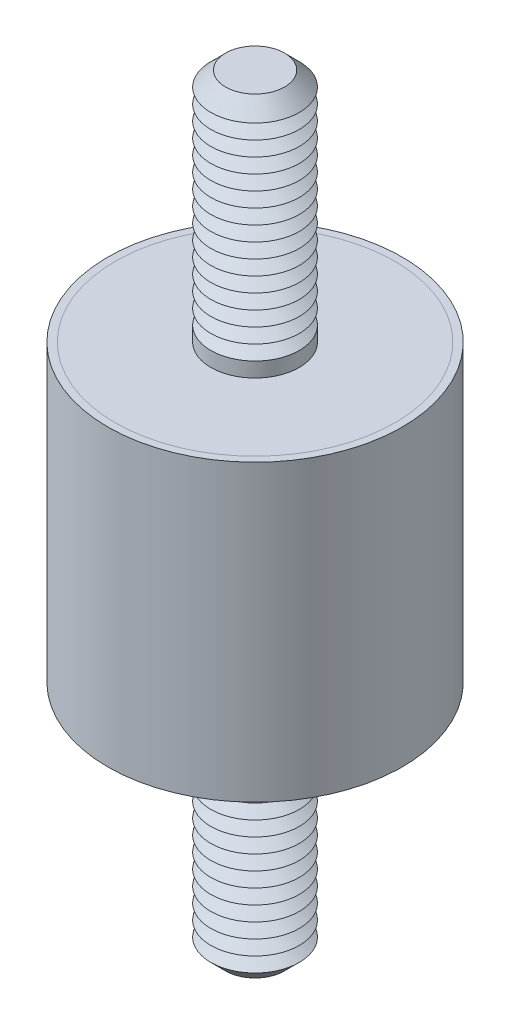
ISO-10303-21;
HEADER;
FILE_DESCRIPTION(('STEP AP214'),'2;1');
FILE_NAME('part.step','',(''),(''),'','','');
FILE_SCHEMA(('AUTOMOTIVE_DESIGN { 1 0 10303 214 1 1 1 1 }'));
ENDSEC;
DATA;
#1=APPLICATION_CONTEXT('core data for automotive mechanical design processes');
#2=APPLICATION_PROTOCOL_DEFINITION('international standard','automotive_design',2000,#1);
#3=PRODUCT_CONTEXT('',#1,'mechanical');
#4=PRODUCT('Part','Part','',(#3));
#5=PRODUCT_RELATED_PRODUCT_CATEGORY('part','',(#4));
#6=PRODUCT_DEFINITION_FORMATION('','',#4);
#7=PRODUCT_DEFINITION_CONTEXT('part definition',#1,'design');
#8=PRODUCT_DEFINITION('design','',#6,#7);
#9=PRODUCT_DEFINITION_SHAPE('','',#8);
#10=(LENGTH_UNIT() NAMED_UNIT(*) SI_UNIT(.MILLI.,.METRE.));
#11=(NAMED_UNIT(*) PLANE_ANGLE_UNIT() SI_UNIT($,.RADIAN.));
#12=(NAMED_UNIT(*) SI_UNIT($,.STERADIAN.) SOLID_ANGLE_UNIT());
#13=UNCERTAINTY_MEASURE_WITH_UNIT(LENGTH_MEASURE(1.E-05),#10,'distance_accuracy_value','');
#14=(GEOMETRIC_REPRESENTATION_CONTEXT(3) GLOBAL_UNCERTAINTY_ASSIGNED_CONTEXT((#13)) GLOBAL_UNIT_ASSIGNED_CONTEXT((#10,
#11,#12)) REPRESENTATION_CONTEXT('',''));
#15=CARTESIAN_POINT('',(0.,0.,0.));
#16=DIRECTION('',(0.,0.,1.));
#17=DIRECTION('',(1.,0.,0.));
#18=AXIS2_PLACEMENT_3D('',#15,#16,#17);
#19=CARTESIAN_POINT('',(0.,-26.,0.));
#20=DIRECTION('',(0.,1.,0.));
#21=DIRECTION('',(0.,0.,1.));
#22=AXIS2_PLACEMENT_3D('',#19,#20,#21);
#23=CYLINDRICAL_SURFACE('',#22,3.);
#24=CARTESIAN_POINT('',(0.,-10.,0.));
#25=DIRECTION('',(0.,-1.,0.));
#26=DIRECTION('',(0.,0.,-1.));
#27=AXIS2_PLACEMENT_3D('',#24,#25,#26);
#28=CIRCLE('',#27,3.);
#29=CARTESIAN_POINT('',(0.,-10.,-3.));
#30=VERTEX_POINT('',#29);
#31=EDGE_CURVE('P0_E21',#30,#30,#28,.T.);
#32=ORIENTED_EDGE('',*,*,#31,.T.);
#33=EDGE_LOOP('',(#32));
#34=FACE_BOUND('',#33,.T.);
#35=CARTESIAN_POINT('',(0.,-11.,0.));
#36=DIRECTION('',(0.,1.,0.));
#37=DIRECTION('',(0.,0.,1.));
#38=AXIS2_PLACEMENT_3D('',#35,#36,#37);
#39=CIRCLE('',#38,3.);
#40=CARTESIAN_POINT('',(0.,-11.,3.));
#41=VERTEX_POINT('',#40);
#42=EDGE_CURVE('P0_E33',#41,#41,#39,.T.);
#43=ORIENTED_EDGE('',*,*,#42,.T.);
#44=EDGE_LOOP('',(#43));
#45=FACE_BOUND('',#44,.T.);
#46=ADVANCED_FACE('P0_F14',(#34,#45),#23,.T.);
#47=CARTESIAN_POINT('',(0.,-10.,0.));
#48=DIRECTION('',(0.,1.,0.));
#49=DIRECTION('',(0.,0.,1.));
#50=AXIS2_PLACEMENT_3D('',#47,#48,#49);
#51=CYLINDRICAL_SURFACE('',#50,9.5);
#52=CARTESIAN_POINT('',(0.,-10.,0.));
#53=DIRECTION('',(0.,1.,0.));
#54=DIRECTION('',(0.,0.,1.));
#55=AXIS2_PLACEMENT_3D('',#52,#53,#54);
#56=CIRCLE('',#55,9.5);
#57=CARTESIAN_POINT('',(0.,-10.,9.5));
#58=VERTEX_POINT('',#57);
#59=EDGE_CURVE('P0_E25',#58,#58,#56,.T.);
#60=ORIENTED_EDGE('',*,*,#59,.T.);
#61=EDGE_LOOP('',(#60));
#62=FACE_BOUND('',#61,.T.);
#63=CARTESIAN_POINT('',(0.,-9.,0.));
#64=DIRECTION('',(0.,1.,0.));
#65=DIRECTION('',(0.,0.,1.));
#66=AXIS2_PLACEMENT_3D('',#63,#64,#65);
#67=CIRCLE('',#66,9.5);
#68=CARTESIAN_POINT('',(0.,-9.,9.5));
#69=VERTEX_POINT('',#68);
#70=EDGE_CURVE('P0_E30',#69,#69,#67,.T.);
#71=ORIENTED_EDGE('',*,*,#70,.F.);
#72=EDGE_LOOP('',(#71));
#73=FACE_BOUND('',#72,.T.);
#74=ADVANCED_FACE('P0_F145',(#62,#73),#51,.T.);
#75=CARTESIAN_POINT('',(0.,-10.,0.));
#76=DIRECTION('',(0.,1.,0.));
#77=DIRECTION('',(0.,0.,1.));
#78=AXIS2_PLACEMENT_3D('',#75,#76,#77);
#79=PLANE('',#78);
#80=ORIENTED_EDGE('',*,*,#31,.F.);
#81=EDGE_LOOP('',(#80));
#82=FACE_BOUND('',#81,.T.);
#83=ORIENTED_EDGE('',*,*,#59,.F.);
#84=EDGE_LOOP('',(#83));
#85=FACE_BOUND('',#84,.T.);
#86=ADVANCED_FACE('P0_F150',(#82,#85),#79,.F.);
#87=CARTESIAN_POINT('',(0.,-9.,0.));
#88=DIRECTION('',(0.,1.,0.));
#89=DIRECTION('',(0.,0.,1.));
#90=AXIS2_PLACEMENT_3D('',#87,#88,#89);
#91=PLANE('',#90);
#92=ORIENTED_EDGE('',*,*,#70,.T.);
#93=EDGE_LOOP('',(#92));
#94=FACE_BOUND('',#93,.T.);
#95=ADVANCED_FACE('P0_F156',(#94),#91,.T.);
#96=CARTESIAN_POINT('',(0.,-11.,0.));
#97=DIRECTION('',(0.,1.,0.));
#98=DIRECTION('',(0.,0.,1.));
#99=AXIS2_PLACEMENT_3D('',#96,#97,#98);
#100=CONICAL_SURFACE('',#99,3.,1.0471975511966);
#101=CARTESIAN_POINT('',(0.,-11.5,0.));
#102=DIRECTION('',(0.,1.,0.));
#103=DIRECTION('',(0.,0.,1.));
#104=AXIS2_PLACEMENT_3D('',#101,#102,#103);
#105=CIRCLE('',#104,2.13397459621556);
#106=CARTESIAN_POINT('',(0.,-11.5,2.13397459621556));
#107=VERTEX_POINT('',#106);
#108=EDGE_CURVE('P0_E39',#107,#107,#105,.T.);
#109=ORIENTED_EDGE('',*,*,#108,.T.);
#110=EDGE_LOOP('',(#109));
#111=FACE_BOUND('',#110,.T.);
#112=ORIENTED_EDGE('',*,*,#42,.F.);
#113=EDGE_LOOP('',(#112));
#114=FACE_BOUND('',#113,.T.);
#115=ADVANCED_FACE('P0_F159',(#111,#114),#100,.T.);
#116=CARTESIAN_POINT('',(0.,-11.5,0.));
#117=DIRECTION('',(0.,-1.,0.));
#118=DIRECTION('',(0.,0.,-1.));
#119=AXIS2_PLACEMENT_3D('',#116,#117,#118);
#120=CONICAL_SURFACE('',#119,2.13397459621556,1.0471975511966);
#121=CARTESIAN_POINT('',(0.,-12.,0.));
#122=DIRECTION('',(0.,1.,0.));
#123=DIRECTION('',(0.,0.,1.));
#124=AXIS2_PLACEMENT_3D('',#121,#122,#123);
#125=CIRCLE('',#124,3.);
#126=CARTESIAN_POINT('',(0.,-12.,3.));
#127=VERTEX_POINT('',#126);
#128=EDGE_CURVE('P0_E43',#127,#127,#125,.T.);
#129=ORIENTED_EDGE('',*,*,#128,.T.);
#130=EDGE_LOOP('',(#129));
#131=FACE_BOUND('',#130,.T.);
#132=ORIENTED_EDGE('',*,*,#108,.F.);
#133=EDGE_LOOP('',(#132));
#134=FACE_BOUND('',#133,.T.);
#135=ADVANCED_FACE('P0_F163',(#131,#134),#120,.T.);
#136=CARTESIAN_POINT('',(0.,-12.,0.));
#137=DIRECTION('',(0.,1.,0.));
#138=DIRECTION('',(0.,0.,1.));
#139=AXIS2_PLACEMENT_3D('',#136,#137,#138);
#140=CONICAL_SURFACE('',#139,3.,1.0471975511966);
#141=CARTESIAN_POINT('',(0.,-12.5,0.));
#142=DIRECTION('',(0.,1.,0.));
#143=DIRECTION('',(0.,0.,1.));
#144=AXIS2_PLACEMENT_3D('',#141,#142,#143);
#145=CIRCLE('',#144,2.13397459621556);
#146=CARTESIAN_POINT('',(0.,-12.5,2.13397459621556));
#147=VERTEX_POINT('',#146);
#148=EDGE_CURVE('P0_E47',#147,#147,#145,.T.);
#149=ORIENTED_EDGE('',*,*,#148,.T.);
#150=EDGE_LOOP('',(#149));
#151=FACE_BOUND('',#150,.T.);
#152=ORIENTED_EDGE('',*,*,#128,.F.);
#153=EDGE_LOOP('',(#152));
#154=FACE_BOUND('',#153,.T.);
#155=ADVANCED_FACE('P0_F167',(#151,#154),#140,.T.);
#156=CARTESIAN_POINT('',(0.,-12.5,0.));
#157=DIRECTION('',(0.,-1.,0.));
#158=DIRECTION('',(0.,0.,-1.));
#159=AXIS2_PLACEMENT_3D('',#156,#157,#158);
#160=CONICAL_SURFACE('',#159,2.13397459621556,1.0471975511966);
#161=CARTESIAN_POINT('',(0.,-13.,0.));
#162=DIRECTION('',(0.,1.,0.));
#163=DIRECTION('',(0.,0.,1.));
#164=AXIS2_PLACEMENT_3D('',#161,#162,#163);
#165=CIRCLE('',#164,3.);
#166=CARTESIAN_POINT('',(0.,-13.,3.));
#167=VERTEX_POINT('',#166);
#168=EDGE_CURVE('P0_E52',#167,#167,#165,.T.);
#169=ORIENTED_EDGE('',*,*,#168,.T.);
#170=EDGE_LOOP('',(#169));
#171=FACE_BOUND('',#170,.T.);
#172=ORIENTED_EDGE('',*,*,#148,.F.);
#173=EDGE_LOOP('',(#172));
#174=FACE_BOUND('',#173,.T.);
#175=ADVANCED_FACE('P0_F174',(#171,#174),#160,.T.);
#176=CARTESIAN_POINT('',(0.,-13.,0.));
#177=DIRECTION('',(0.,1.,0.));
#178=DIRECTION('',(0.,0.,1.));
#179=AXIS2_PLACEMENT_3D('',#176,#177,#178);
#180=CONICAL_SURFACE('',#179,3.,1.0471975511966);
#181=CARTESIAN_POINT('',(0.,-13.5,0.));
#182=DIRECTION('',(0.,1.,0.));
#183=DIRECTION('',(0.,0.,1.));
#184=AXIS2_PLACEMENT_3D('',#181,#182,#183);
#185=CIRCLE('',#184,2.13397459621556);
#186=CARTESIAN_POINT('',(0.,-13.5,2.13397459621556));
#187=VERTEX_POINT('',#186);
#188=EDGE_CURVE('P0_E55',#187,#187,#185,.T.);
#189=ORIENTED_EDGE('',*,*,#188,.T.);
#190=EDGE_LOOP('',(#189));
#191=FACE_BOUND('',#190,.T.);
#192=ORIENTED_EDGE('',*,*,#168,.F.);
#193=EDGE_LOOP('',(#192));
#194=FACE_BOUND('',#193,.T.);
#195=ADVANCED_FACE('P0_F178',(#191,#194),#180,.T.);
#196=CARTESIAN_POINT('',(0.,-13.5,0.));
#197=DIRECTION('',(0.,-1.,0.));
#198=DIRECTION('',(0.,0.,-1.));
#199=AXIS2_PLACEMENT_3D('',#196,#197,#198);
#200=CONICAL_SURFACE('',#199,2.13397459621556,1.0471975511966);
#201=CARTESIAN_POINT('',(0.,-14.,0.));
#202=DIRECTION('',(0.,1.,0.));
#203=DIRECTION('',(0.,0.,1.));
#204=AXIS2_PLACEMENT_3D('',#201,#202,#203);
#205=CIRCLE('',#204,3.);
#206=CARTESIAN_POINT('',(0.,-14.,3.));
#207=VERTEX_POINT('',#206);
#208=EDGE_CURVE('P0_E58',#207,#207,#205,.T.);
#209=ORIENTED_EDGE('',*,*,#208,.T.);
#210=EDGE_LOOP('',(#209));
#211=FACE_BOUND('',#210,.T.);
#212=ORIENTED_EDGE('',*,*,#188,.F.);
#213=EDGE_LOOP('',(#212));
#214=FACE_BOUND('',#213,.T.);
#215=ADVANCED_FACE('P0_F182',(#211,#214),#200,.T.);
#216=CARTESIAN_POINT('',(0.,-14.,0.));
#217=DIRECTION('',(0.,1.,0.));
#218=DIRECTION('',(0.,0.,1.));
#219=AXIS2_PLACEMENT_3D('',#216,#217,#218);
#220=CONICAL_SURFACE('',#219,3.,1.0471975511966);
#221=CARTESIAN_POINT('',(0.,-14.5,0.));
#222=DIRECTION('',(0.,1.,0.));
#223=DIRECTION('',(0.,0.,1.));
#224=AXIS2_PLACEMENT_3D('',#221,#222,#223);
#225=CIRCLE('',#224,2.13397459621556);
#226=CARTESIAN_POINT('',(0.,-14.5,2.13397459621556));
#227=VERTEX_POINT('',#226);
#228=EDGE_CURVE('P0_E61',#227,#227,#225,.T.);
#229=ORIENTED_EDGE('',*,*,#228,.T.);
#230=EDGE_LOOP('',(#229));
#231=FACE_BOUND('',#230,.T.);
#232=ORIENTED_EDGE('',*,*,#208,.F.);
#233=EDGE_LOOP('',(#232));
#234=FACE_BOUND('',#233,.T.);
#235=ADVANCED_FACE('P0_F186',(#231,#234),#220,.T.);
#236=CARTESIAN_POINT('',(0.,-14.5,0.));
#237=DIRECTION('',(0.,-1.,0.));
#238=DIRECTION('',(0.,0.,-1.));
#239=AXIS2_PLACEMENT_3D('',#236,#237,#238);
#240=CONICAL_SURFACE('',#239,2.13397459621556,1.0471975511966);
#241=CARTESIAN_POINT('',(0.,-15.,0.));
#242=DIRECTION('',(0.,1.,0.));
#243=DIRECTION('',(0.,0.,1.));
#244=AXIS2_PLACEMENT_3D('',#241,#242,#243);
#245=CIRCLE('',#244,3.);
#246=CARTESIAN_POINT('',(0.,-15.,3.));
#247=VERTEX_POINT('',#246);
#248=EDGE_CURVE('P0_E64',#247,#247,#245,.T.);
#249=ORIENTED_EDGE('',*,*,#248,.T.);
#250=EDGE_LOOP('',(#249));
#251=FACE_BOUND('',#250,.T.);
#252=ORIENTED_EDGE('',*,*,#228,.F.);
#253=EDGE_LOOP('',(#252));
#254=FACE_BOUND('',#253,.T.);
#255=ADVANCED_FACE('P0_F190',(#251,#254),#240,.T.);
#256=CARTESIAN_POINT('',(0.,-15.,0.));
#257=DIRECTION('',(0.,1.,0.));
#258=DIRECTION('',(0.,0.,1.));
#259=AXIS2_PLACEMENT_3D('',#256,#257,#258);
#260=CONICAL_SURFACE('',#259,3.,1.0471975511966);
#261=CARTESIAN_POINT('',(0.,-15.5,0.));
#262=DIRECTION('',(0.,1.,0.));
#263=DIRECTION('',(0.,0.,1.));
#264=AXIS2_PLACEMENT_3D('',#261,#262,#263);
#265=CIRCLE('',#264,2.13397459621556);
#266=CARTESIAN_POINT('',(0.,-15.5,2.13397459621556));
#267=VERTEX_POINT('',#266);
#268=EDGE_CURVE('P0_E67',#267,#267,#265,.T.);
#269=ORIENTED_EDGE('',*,*,#268,.T.);
#270=EDGE_LOOP('',(#269));
#271=FACE_BOUND('',#270,.T.);
#272=ORIENTED_EDGE('',*,*,#248,.F.);
#273=EDGE_LOOP('',(#272));
#274=FACE_BOUND('',#273,.T.);
#275=ADVANCED_FACE('P0_F194',(#271,#274),#260,.T.);
#276=CARTESIAN_POINT('',(0.,-15.5,0.));
#277=DIRECTION('',(0.,-1.,0.));
#278=DIRECTION('',(0.,0.,-1.));
#279=AXIS2_PLACEMENT_3D('',#276,#277,#278);
#280=CONICAL_SURFACE('',#279,2.13397459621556,1.0471975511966);
#281=CARTESIAN_POINT('',(0.,-16.,0.));
#282=DIRECTION('',(0.,1.,0.));
#283=DIRECTION('',(0.,0.,1.));
#284=AXIS2_PLACEMENT_3D('',#281,#282,#283);
#285=CIRCLE('',#284,3.);
#286=CARTESIAN_POINT('',(0.,-16.,3.));
#287=VERTEX_POINT('',#286);
#288=EDGE_CURVE('P0_E70',#287,#287,#285,.T.);
#289=ORIENTED_EDGE('',*,*,#288,.T.);
#290=EDGE_LOOP('',(#289));
#291=FACE_BOUND('',#290,.T.);
#292=ORIENTED_EDGE('',*,*,#268,.F.);
#293=EDGE_LOOP('',(#292));
#294=FACE_BOUND('',#293,.T.);
#295=ADVANCED_FACE('P0_F198',(#291,#294),#280,.T.);
#296=CARTESIAN_POINT('',(0.,-16.,0.));
#297=DIRECTION('',(0.,1.,0.));
#298=DIRECTION('',(0.,0.,1.));
#299=AXIS2_PLACEMENT_3D('',#296,#297,#298);
#300=CONICAL_SURFACE('',#299,3.,1.0471975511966);
#301=CARTESIAN_POINT('',(0.,-16.5,0.));
#302=DIRECTION('',(0.,1.,0.));
#303=DIRECTION('',(0.,0.,1.));
#304=AXIS2_PLACEMENT_3D('',#301,#302,#303);
#305=CIRCLE('',#304,2.13397459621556);
#306=CARTESIAN_POINT('',(0.,-16.5,2.13397459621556));
#307=VERTEX_POINT('',#306);
#308=EDGE_CURVE('P0_E73',#307,#307,#305,.T.);
#309=ORIENTED_EDGE('',*,*,#308,.T.);
#310=EDGE_LOOP('',(#309));
#311=FACE_BOUND('',#310,.T.);
#312=ORIENTED_EDGE('',*,*,#288,.F.);
#313=EDGE_LOOP('',(#312));
#314=FACE_BOUND('',#313,.T.);
#315=ADVANCED_FACE('P0_F202',(#311,#314),#300,.T.);
#316=CARTESIAN_POINT('',(0.,-16.5,0.));
#317=DIRECTION('',(0.,-1.,0.));
#318=DIRECTION('',(0.,0.,-1.));
#319=AXIS2_PLACEMENT_3D('',#316,#317,#318);
#320=CONICAL_SURFACE('',#319,2.13397459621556,1.0471975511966);
#321=CARTESIAN_POINT('',(0.,-17.,0.));
#322=DIRECTION('',(0.,1.,0.));
#323=DIRECTION('',(0.,0.,1.));
#324=AXIS2_PLACEMENT_3D('',#321,#322,#323);
#325=CIRCLE('',#324,3.);
#326=CARTESIAN_POINT('',(0.,-17.,3.));
#327=VERTEX_POINT('',#326);
#328=EDGE_CURVE('P0_E76',#327,#327,#325,.T.);
#329=ORIENTED_EDGE('',*,*,#328,.T.);
#330=EDGE_LOOP('',(#329));
#331=FACE_BOUND('',#330,.T.);
#332=ORIENTED_EDGE('',*,*,#308,.F.);
#333=EDGE_LOOP('',(#332));
#334=FACE_BOUND('',#333,.T.);
#335=ADVANCED_FACE('P0_F206',(#331,#334),#320,.T.);
#336=CARTESIAN_POINT('',(0.,-17.,0.));
#337=DIRECTION('',(0.,1.,0.));
#338=DIRECTION('',(0.,0.,1.));
#339=AXIS2_PLACEMENT_3D('',#336,#337,#338);
#340=CONICAL_SURFACE('',#339,3.,1.0471975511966);
#341=CARTESIAN_POINT('',(0.,-17.5,0.));
#342=DIRECTION('',(0.,1.,0.));
#343=DIRECTION('',(0.,0.,1.));
#344=AXIS2_PLACEMENT_3D('',#341,#342,#343);
#345=CIRCLE('',#344,2.13397459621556);
#346=CARTESIAN_POINT('',(0.,-17.5,2.13397459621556));
#347=VERTEX_POINT('',#346);
#348=EDGE_CURVE('P0_E79',#347,#347,#345,.T.);
#349=ORIENTED_EDGE('',*,*,#348,.T.);
#350=EDGE_LOOP('',(#349));
#351=FACE_BOUND('',#350,.T.);
#352=ORIENTED_EDGE('',*,*,#328,.F.);
#353=EDGE_LOOP('',(#352));
#354=FACE_BOUND('',#353,.T.);
#355=ADVANCED_FACE('P0_F210',(#351,#354),#340,.T.);
#356=CARTESIAN_POINT('',(0.,-17.5,0.));
#357=DIRECTION('',(0.,-1.,0.));
#358=DIRECTION('',(0.,0.,-1.));
#359=AXIS2_PLACEMENT_3D('',#356,#357,#358);
#360=CONICAL_SURFACE('',#359,2.13397459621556,1.0471975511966);
#361=CARTESIAN_POINT('',(0.,-18.,0.));
#362=DIRECTION('',(0.,1.,0.));
#363=DIRECTION('',(0.,0.,1.));
#364=AXIS2_PLACEMENT_3D('',#361,#362,#363);
#365=CIRCLE('',#364,3.);
#366=CARTESIAN_POINT('',(0.,-18.,3.));
#367=VERTEX_POINT('',#366);
#368=EDGE_CURVE('P0_E82',#367,#367,#365,.T.);
#369=ORIENTED_EDGE('',*,*,#368,.T.);
#370=EDGE_LOOP('',(#369));
#371=FACE_BOUND('',#370,.T.);
#372=ORIENTED_EDGE('',*,*,#348,.F.);
#373=EDGE_LOOP('',(#372));
#374=FACE_BOUND('',#373,.T.);
#375=ADVANCED_FACE('P0_F214',(#371,#374),#360,.T.);
#376=CARTESIAN_POINT('',(0.,-18.,0.));
#377=DIRECTION('',(0.,1.,0.));
#378=DIRECTION('',(0.,0.,1.));
#379=AXIS2_PLACEMENT_3D('',#376,#377,#378);
#380=CONICAL_SURFACE('',#379,3.,1.0471975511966);
#381=CARTESIAN_POINT('',(0.,-18.5,0.));
#382=DIRECTION('',(0.,1.,0.));
#383=DIRECTION('',(0.,0.,1.));
#384=AXIS2_PLACEMENT_3D('',#381,#382,#383);
#385=CIRCLE('',#384,2.13397459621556);
#386=CARTESIAN_POINT('',(0.,-18.5,2.13397459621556));
#387=VERTEX_POINT('',#386);
#388=EDGE_CURVE('P0_E85',#387,#387,#385,.T.);
#389=ORIENTED_EDGE('',*,*,#388,.T.);
#390=EDGE_LOOP('',(#389));
#391=FACE_BOUND('',#390,.T.);
#392=ORIENTED_EDGE('',*,*,#368,.F.);
#393=EDGE_LOOP('',(#392));
#394=FACE_BOUND('',#393,.T.);
#395=ADVANCED_FACE('P0_F218',(#391,#394),#380,.T.);
#396=CARTESIAN_POINT('',(0.,-18.5,0.));
#397=DIRECTION('',(0.,-1.,0.));
#398=DIRECTION('',(0.,0.,-1.));
#399=AXIS2_PLACEMENT_3D('',#396,#397,#398);
#400=CONICAL_SURFACE('',#399,2.13397459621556,1.0471975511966);
#401=CARTESIAN_POINT('',(0.,-19.,0.));
#402=DIRECTION('',(0.,1.,0.));
#403=DIRECTION('',(0.,0.,1.));
#404=AXIS2_PLACEMENT_3D('',#401,#402,#403);
#405=CIRCLE('',#404,3.);
#406=CARTESIAN_POINT('',(0.,-19.,3.));
#407=VERTEX_POINT('',#406);
#408=EDGE_CURVE('P0_E88',#407,#407,#405,.T.);
#409=ORIENTED_EDGE('',*,*,#408,.T.);
#410=EDGE_LOOP('',(#409));
#411=FACE_BOUND('',#410,.T.);
#412=ORIENTED_EDGE('',*,*,#388,.F.);
#413=EDGE_LOOP('',(#412));
#414=FACE_BOUND('',#413,.T.);
#415=ADVANCED_FACE('P0_F222',(#411,#414),#400,.T.);
#416=CARTESIAN_POINT('',(0.,-19.,0.));
#417=DIRECTION('',(0.,1.,0.));
#418=DIRECTION('',(0.,0.,1.));
#419=AXIS2_PLACEMENT_3D('',#416,#417,#418);
#420=CONICAL_SURFACE('',#419,3.,1.0471975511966);
#421=CARTESIAN_POINT('',(0.,-19.5,0.));
#422=DIRECTION('',(0.,1.,0.));
#423=DIRECTION('',(0.,0.,1.));
#424=AXIS2_PLACEMENT_3D('',#421,#422,#423);
#425=CIRCLE('',#424,2.13397459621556);
#426=CARTESIAN_POINT('',(0.,-19.5,2.13397459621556));
#427=VERTEX_POINT('',#426);
#428=EDGE_CURVE('P0_E91',#427,#427,#425,.T.);
#429=ORIENTED_EDGE('',*,*,#428,.T.);
#430=EDGE_LOOP('',(#429));
#431=FACE_BOUND('',#430,.T.);
#432=ORIENTED_EDGE('',*,*,#408,.F.);
#433=EDGE_LOOP('',(#432));
#434=FACE_BOUND('',#433,.T.);
#435=ADVANCED_FACE('P0_F226',(#431,#434),#420,.T.);
#436=CARTESIAN_POINT('',(0.,-19.5,0.));
#437=DIRECTION('',(0.,-1.,0.));
#438=DIRECTION('',(0.,0.,-1.));
#439=AXIS2_PLACEMENT_3D('',#436,#437,#438);
#440=CONICAL_SURFACE('',#439,2.13397459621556,1.0471975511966);
#441=CARTESIAN_POINT('',(0.,-20.,0.));
#442=DIRECTION('',(0.,1.,0.));
#443=DIRECTION('',(0.,0.,1.));
#444=AXIS2_PLACEMENT_3D('',#441,#442,#443);
#445=CIRCLE('',#444,3.);
#446=CARTESIAN_POINT('',(0.,-20.,3.));
#447=VERTEX_POINT('',#446);
#448=EDGE_CURVE('P0_E94',#447,#447,#445,.T.);
#449=ORIENTED_EDGE('',*,*,#448,.T.);
#450=EDGE_LOOP('',(#449));
#451=FACE_BOUND('',#450,.T.);
#452=ORIENTED_EDGE('',*,*,#428,.F.);
#453=EDGE_LOOP('',(#452));
#454=FACE_BOUND('',#453,.T.);
#455=ADVANCED_FACE('P0_F230',(#451,#454),#440,.T.);
#456=CARTESIAN_POINT('',(0.,-20.,0.));
#457=DIRECTION('',(0.,1.,0.));
#458=DIRECTION('',(0.,0.,1.));
#459=AXIS2_PLACEMENT_3D('',#456,#457,#458);
#460=CONICAL_SURFACE('',#459,3.,1.0471975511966);
#461=CARTESIAN_POINT('',(0.,-20.5,0.));
#462=DIRECTION('',(0.,1.,0.));
#463=DIRECTION('',(0.,0.,1.));
#464=AXIS2_PLACEMENT_3D('',#461,#462,#463);
#465=CIRCLE('',#464,2.13397459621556);
#466=CARTESIAN_POINT('',(0.,-20.5,2.13397459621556));
#467=VERTEX_POINT('',#466);
#468=EDGE_CURVE('P0_E97',#467,#467,#465,.T.);
#469=ORIENTED_EDGE('',*,*,#468,.T.);
#470=EDGE_LOOP('',(#469));
#471=FACE_BOUND('',#470,.T.);
#472=ORIENTED_EDGE('',*,*,#448,.F.);
#473=EDGE_LOOP('',(#472));
#474=FACE_BOUND('',#473,.T.);
#475=ADVANCED_FACE('P0_F234',(#471,#474),#460,.T.);
#476=CARTESIAN_POINT('',(0.,-20.5,0.));
#477=DIRECTION('',(0.,-1.,0.));
#478=DIRECTION('',(0.,0.,-1.));
#479=AXIS2_PLACEMENT_3D('',#476,#477,#478);
#480=CONICAL_SURFACE('',#479,2.13397459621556,1.0471975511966);
#481=CARTESIAN_POINT('',(0.,-21.,0.));
#482=DIRECTION('',(0.,1.,0.));
#483=DIRECTION('',(0.,0.,1.));
#484=AXIS2_PLACEMENT_3D('',#481,#482,#483);
#485=CIRCLE('',#484,3.);
#486=CARTESIAN_POINT('',(0.,-21.,3.));
#487=VERTEX_POINT('',#486);
#488=EDGE_CURVE('P0_E100',#487,#487,#485,.T.);
#489=ORIENTED_EDGE('',*,*,#488,.T.);
#490=EDGE_LOOP('',(#489));
#491=FACE_BOUND('',#490,.T.);
#492=ORIENTED_EDGE('',*,*,#468,.F.);
#493=EDGE_LOOP('',(#492));
#494=FACE_BOUND('',#493,.T.);
#495=ADVANCED_FACE('P0_F238',(#491,#494),#480,.T.);
#496=CARTESIAN_POINT('',(0.,-21.,0.));
#497=DIRECTION('',(0.,1.,0.));
#498=DIRECTION('',(0.,0.,1.));
#499=AXIS2_PLACEMENT_3D('',#496,#497,#498);
#500=CONICAL_SURFACE('',#499,3.,1.0471975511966);
#501=CARTESIAN_POINT('',(0.,-21.5,0.));
#502=DIRECTION('',(0.,1.,0.));
#503=DIRECTION('',(0.,0.,1.));
#504=AXIS2_PLACEMENT_3D('',#501,#502,#503);
#505=CIRCLE('',#504,2.13397459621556);
#506=CARTESIAN_POINT('',(0.,-21.5,2.13397459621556));
#507=VERTEX_POINT('',#506);
#508=EDGE_CURVE('P0_E103',#507,#507,#505,.T.);
#509=ORIENTED_EDGE('',*,*,#508,.T.);
#510=EDGE_LOOP('',(#509));
#511=FACE_BOUND('',#510,.T.);
#512=ORIENTED_EDGE('',*,*,#488,.F.);
#513=EDGE_LOOP('',(#512));
#514=FACE_BOUND('',#513,.T.);
#515=ADVANCED_FACE('P0_F242',(#511,#514),#500,.T.);
#516=CARTESIAN_POINT('',(0.,-21.5,0.));
#517=DIRECTION('',(0.,-1.,0.));
#518=DIRECTION('',(0.,0.,-1.));
#519=AXIS2_PLACEMENT_3D('',#516,#517,#518);
#520=CONICAL_SURFACE('',#519,2.13397459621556,1.0471975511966);
#521=CARTESIAN_POINT('',(0.,-22.,0.));
#522=DIRECTION('',(0.,1.,0.));
#523=DIRECTION('',(0.,0.,1.));
#524=AXIS2_PLACEMENT_3D('',#521,#522,#523);
#525=CIRCLE('',#524,3.);
#526=CARTESIAN_POINT('',(0.,-22.,3.));
#527=VERTEX_POINT('',#526);
#528=EDGE_CURVE('P0_E106',#527,#527,#525,.T.);
#529=ORIENTED_EDGE('',*,*,#528,.T.);
#530=EDGE_LOOP('',(#529));
#531=FACE_BOUND('',#530,.T.);
#532=ORIENTED_EDGE('',*,*,#508,.F.);
#533=EDGE_LOOP('',(#532));
#534=FACE_BOUND('',#533,.T.);
#535=ADVANCED_FACE('P0_F246',(#531,#534),#520,.T.);
#536=CARTESIAN_POINT('',(0.,-22.,0.));
#537=DIRECTION('',(0.,1.,0.));
#538=DIRECTION('',(0.,0.,1.));
#539=AXIS2_PLACEMENT_3D('',#536,#537,#538);
#540=CONICAL_SURFACE('',#539,3.,1.0471975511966);
#541=CARTESIAN_POINT('',(0.,-22.5,0.));
#542=DIRECTION('',(0.,1.,0.));
#543=DIRECTION('',(0.,0.,1.));
#544=AXIS2_PLACEMENT_3D('',#541,#542,#543);
#545=CIRCLE('',#544,2.13397459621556);
#546=CARTESIAN_POINT('',(0.,-22.5,2.13397459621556));
#547=VERTEX_POINT('',#546);
#548=EDGE_CURVE('P0_E109',#547,#547,#545,.T.);
#549=ORIENTED_EDGE('',*,*,#548,.T.);
#550=EDGE_LOOP('',(#549));
#551=FACE_BOUND('',#550,.T.);
#552=ORIENTED_EDGE('',*,*,#528,.F.);
#553=EDGE_LOOP('',(#552));
#554=FACE_BOUND('',#553,.T.);
#555=ADVANCED_FACE('P0_F250',(#551,#554),#540,.T.);
#556=CARTESIAN_POINT('',(0.,-22.5,0.));
#557=DIRECTION('',(0.,-1.,0.));
#558=DIRECTION('',(0.,0.,-1.));
#559=AXIS2_PLACEMENT_3D('',#556,#557,#558);
#560=CONICAL_SURFACE('',#559,2.13397459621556,1.0471975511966);
#561=CARTESIAN_POINT('',(0.,-23.,0.));
#562=DIRECTION('',(0.,1.,0.));
#563=DIRECTION('',(0.,0.,1.));
#564=AXIS2_PLACEMENT_3D('',#561,#562,#563);
#565=CIRCLE('',#564,3.);
#566=CARTESIAN_POINT('',(0.,-23.,3.));
#567=VERTEX_POINT('',#566);
#568=EDGE_CURVE('P0_E112',#567,#567,#565,.T.);
#569=ORIENTED_EDGE('',*,*,#568,.T.);
#570=EDGE_LOOP('',(#569));
#571=FACE_BOUND('',#570,.T.);
#572=ORIENTED_EDGE('',*,*,#548,.F.);
#573=EDGE_LOOP('',(#572));
#574=FACE_BOUND('',#573,.T.);
#575=ADVANCED_FACE('P0_F254',(#571,#574),#560,.T.);
#576=CARTESIAN_POINT('',(0.,-23.,0.));
#577=DIRECTION('',(0.,1.,0.));
#578=DIRECTION('',(0.,0.,1.));
#579=AXIS2_PLACEMENT_3D('',#576,#577,#578);
#580=CONICAL_SURFACE('',#579,3.,1.0471975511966);
#581=CARTESIAN_POINT('',(0.,-23.5,0.));
#582=DIRECTION('',(0.,1.,0.));
#583=DIRECTION('',(0.,0.,1.));
#584=AXIS2_PLACEMENT_3D('',#581,#582,#583);
#585=CIRCLE('',#584,2.13397459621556);
#586=CARTESIAN_POINT('',(0.,-23.5,2.13397459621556));
#587=VERTEX_POINT('',#586);
#588=EDGE_CURVE('P0_E115',#587,#587,#585,.T.);
#589=ORIENTED_EDGE('',*,*,#588,.T.);
#590=EDGE_LOOP('',(#589));
#591=FACE_BOUND('',#590,.T.);
#592=ORIENTED_EDGE('',*,*,#568,.F.);
#593=EDGE_LOOP('',(#592));
#594=FACE_BOUND('',#593,.T.);
#595=ADVANCED_FACE('P0_F258',(#591,#594),#580,.T.);
#596=CARTESIAN_POINT('',(0.,-23.5,0.));
#597=DIRECTION('',(0.,-1.,0.));
#598=DIRECTION('',(0.,0.,-1.));
#599=AXIS2_PLACEMENT_3D('',#596,#597,#598);
#600=CONICAL_SURFACE('',#599,2.13397459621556,1.0471975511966);
#601=CARTESIAN_POINT('',(0.,-24.,0.));
#602=DIRECTION('',(0.,1.,0.));
#603=DIRECTION('',(0.,0.,1.));
#604=AXIS2_PLACEMENT_3D('',#601,#602,#603);
#605=CIRCLE('',#604,3.);
#606=CARTESIAN_POINT('',(0.,-24.,3.));
#607=VERTEX_POINT('',#606);
#608=EDGE_CURVE('P0_E118',#607,#607,#605,.T.);
#609=ORIENTED_EDGE('',*,*,#608,.T.);
#610=EDGE_LOOP('',(#609));
#611=FACE_BOUND('',#610,.T.);
#612=ORIENTED_EDGE('',*,*,#588,.F.);
#613=EDGE_LOOP('',(#612));
#614=FACE_BOUND('',#613,.T.);
#615=ADVANCED_FACE('P0_F142',(#611,#614),#600,.T.);
#616=CARTESIAN_POINT('',(0.,-24.,0.));
#617=DIRECTION('',(0.,1.,0.));
#618=DIRECTION('',(0.,0.,1.));
#619=AXIS2_PLACEMENT_3D('',#616,#617,#618);
#620=CONICAL_SURFACE('',#619,3.,1.0471975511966);
#621=CARTESIAN_POINT('',(0.,-24.5,0.));
#622=DIRECTION('',(0.,1.,0.));
#623=DIRECTION('',(0.,0.,1.));
#624=AXIS2_PLACEMENT_3D('',#621,#622,#623);
#625=CIRCLE('',#624,2.13397459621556);
#626=CARTESIAN_POINT('',(0.,-24.5,2.13397459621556));
#627=VERTEX_POINT('',#626);
#628=EDGE_CURVE('P0_E124',#627,#627,#625,.T.);
#629=ORIENTED_EDGE('',*,*,#628,.T.);
#630=EDGE_LOOP('',(#629));
#631=FACE_BOUND('',#630,.T.);
#632=ORIENTED_EDGE('',*,*,#608,.F.);
#633=EDGE_LOOP('',(#632));
#634=FACE_BOUND('',#633,.T.);
#635=ADVANCED_FACE('P0_F128',(#631,#634),#620,.T.);
#636=CARTESIAN_POINT('',(0.,-24.5,0.));
#637=DIRECTION('',(0.,-1.,0.));
#638=DIRECTION('',(0.,0.,-1.));
#639=AXIS2_PLACEMENT_3D('',#636,#637,#638);
#640=CONICAL_SURFACE('',#639,2.13397459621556,1.0471975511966);
#641=CARTESIAN_POINT('',(0.,-25.,0.));
#642=DIRECTION('',(0.,1.,0.));
#643=DIRECTION('',(0.,0.,1.));
#644=AXIS2_PLACEMENT_3D('',#641,#642,#643);
#645=CIRCLE('',#644,3.);
#646=CARTESIAN_POINT('',(0.,-25.,3.));
#647=VERTEX_POINT('',#646);
#648=EDGE_CURVE('P0_E121',#647,#647,#645,.T.);
#649=ORIENTED_EDGE('',*,*,#648,.T.);
#650=EDGE_LOOP('',(#649));
#651=FACE_BOUND('',#650,.T.);
#652=ORIENTED_EDGE('',*,*,#628,.F.);
#653=EDGE_LOOP('',(#652));
#654=FACE_BOUND('',#653,.T.);
#655=ADVANCED_FACE('P0_F131',(#651,#654),#640,.T.);
#656=CARTESIAN_POINT('',(0.,-26.,0.));
#657=DIRECTION('',(0.,-1.,0.));
#658=DIRECTION('',(0.,0.,-1.));
#659=AXIS2_PLACEMENT_3D('',#656,#657,#658);
#660=PLANE('',#659);
#661=CARTESIAN_POINT('',(0.,-26.,0.));
#662=DIRECTION('',(0.,-1.,0.));
#663=DIRECTION('',(0.,0.,-1.));
#664=AXIS2_PLACEMENT_3D('',#661,#662,#663);
#665=CIRCLE('',#664,2.);
#666=CARTESIAN_POINT('',(0.,-26.,-2.));
#667=VERTEX_POINT('',#666);
#668=EDGE_CURVE('P0_E10',#667,#667,#665,.T.);
#669=ORIENTED_EDGE('',*,*,#668,.T.);
#670=EDGE_LOOP('',(#669));
#671=FACE_BOUND('',#670,.T.);
#672=ADVANCED_FACE('P0_F133',(#671),#660,.T.);
#673=CARTESIAN_POINT('',(0.,-26.,0.));
#674=DIRECTION('',(0.,1.,0.));
#675=DIRECTION('',(0.,0.,1.));
#676=AXIS2_PLACEMENT_3D('',#673,#674,#675);
#677=CONICAL_SURFACE('',#676,2.,0.785398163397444);
#678=ORIENTED_EDGE('',*,*,#648,.F.);
#679=EDGE_LOOP('',(#678));
#680=FACE_BOUND('',#679,.T.);
#681=ORIENTED_EDGE('',*,*,#668,.F.);
#682=EDGE_LOOP('',(#681));
#683=FACE_BOUND('',#682,.T.);
#684=ADVANCED_FACE('P0_F16',(#680,#683),#677,.T.);
#685=CLOSED_SHELL('',(#46,#74,#86,#95,#115,#135,#155,#175,#195,#215,#235,#255,#275,#295,#315,
#335,#355,#375,#395,#415,#435,#455,#475,#495,#515,#535,#555,#575,#595,#615,#635,#655,#672,#684));
#686=MANIFOLD_SOLID_BREP('P0_B1',#685);
#687=CARTESIAN_POINT('',(0.,26.,0.));
#688=DIRECTION('',(0.,-1.,0.));
#689=DIRECTION('',(0.,0.,-1.));
#690=AXIS2_PLACEMENT_3D('',#687,#688,#689);
#691=CYLINDRICAL_SURFACE('',#690,3.);
#692=CARTESIAN_POINT('',(0.,11.,0.));
#693=DIRECTION('',(0.,1.,0.));
#694=DIRECTION('',(0.,0.,1.));
#695=AXIS2_PLACEMENT_3D('',#692,#693,#694);
#696=CIRCLE('',#695,3.);
#697=CARTESIAN_POINT('',(0.,11.,3.));
#698=VERTEX_POINT('',#697);
#699=EDGE_CURVE('P1_E33',#698,#698,#696,.T.);
#700=ORIENTED_EDGE('',*,*,#699,.F.);
#701=EDGE_LOOP('',(#700));
#702=FACE_BOUND('',#701,.T.);
#703=CARTESIAN_POINT('',(0.,10.,0.));
#704=DIRECTION('',(0.,1.,0.));
#705=DIRECTION('',(0.,0.,1.));
#706=AXIS2_PLACEMENT_3D('',#703,#704,#705);
#707=CIRCLE('',#706,3.);
#708=CARTESIAN_POINT('',(0.,10.,3.));
#709=VERTEX_POINT('',#708);
#710=EDGE_CURVE('P1_E21',#709,#709,#707,.T.);
#711=ORIENTED_EDGE('',*,*,#710,.T.);
#712=EDGE_LOOP('',(#711));
#713=FACE_BOUND('',#712,.T.);
#714=ADVANCED_FACE('P1_F14',(#702,#713),#691,.T.);
#715=CARTESIAN_POINT('',(0.,10.,0.));
#716=DIRECTION('',(0.,-1.,0.));
#717=DIRECTION('',(0.,0.,-1.));
#718=AXIS2_PLACEMENT_3D('',#715,#716,#717);
#719=CYLINDRICAL_SURFACE('',#718,9.5);
#720=CARTESIAN_POINT('',(0.,10.,0.));
#721=DIRECTION('',(0.,1.,0.));
#722=DIRECTION('',(0.,0.,1.));
#723=AXIS2_PLACEMENT_3D('',#720,#721,#722);
#724=CIRCLE('',#723,9.5);
#725=CARTESIAN_POINT('',(0.,10.,9.5));
#726=VERTEX_POINT('',#725);
#727=EDGE_CURVE('P1_E25',#726,#726,#724,.T.);
#728=ORIENTED_EDGE('',*,*,#727,.F.);
#729=EDGE_LOOP('',(#728));
#730=FACE_BOUND('',#729,.T.);
#731=CARTESIAN_POINT('',(0.,9.,0.));
#732=DIRECTION('',(0.,1.,0.));
#733=DIRECTION('',(0.,0.,1.));
#734=AXIS2_PLACEMENT_3D('',#731,#732,#733);
#735=CIRCLE('',#734,9.5);
#736=CARTESIAN_POINT('',(0.,9.,9.5));
#737=VERTEX_POINT('',#736);
#738=EDGE_CURVE('P1_E30',#737,#737,#735,.T.);
#739=ORIENTED_EDGE('',*,*,#738,.T.);
#740=EDGE_LOOP('',(#739));
#741=FACE_BOUND('',#740,.T.);
#742=ADVANCED_FACE('P1_F292',(#730,#741),#719,.T.);
#743=CARTESIAN_POINT('',(0.,10.,0.));
#744=DIRECTION('',(0.,1.,0.));
#745=DIRECTION('',(0.,0.,1.));
#746=AXIS2_PLACEMENT_3D('',#743,#744,#745);
#747=PLANE('',#746);
#748=ORIENTED_EDGE('',*,*,#710,.F.);
#749=EDGE_LOOP('',(#748));
#750=FACE_BOUND('',#749,.T.);
#751=ORIENTED_EDGE('',*,*,#727,.T.);
#752=EDGE_LOOP('',(#751));
#753=FACE_BOUND('',#752,.T.);
#754=ADVANCED_FACE('P1_F298',(#750,#753),#747,.T.);
#755=CARTESIAN_POINT('',(0.,9.,0.));
#756=DIRECTION('',(0.,1.,0.));
#757=DIRECTION('',(0.,0.,1.));
#758=AXIS2_PLACEMENT_3D('',#755,#756,#757);
#759=PLANE('',#758);
#760=ORIENTED_EDGE('',*,*,#738,.F.);
#761=EDGE_LOOP('',(#760));
#762=FACE_BOUND('',#761,.T.);
#763=ADVANCED_FACE('P1_F288',(#762),#759,.F.);
#764=CARTESIAN_POINT('',(0.,11.,0.));
#765=DIRECTION('',(0.,-1.,0.));
#766=DIRECTION('',(0.,0.,-1.));
#767=AXIS2_PLACEMENT_3D('',#764,#765,#766);
#768=CONICAL_SURFACE('',#767,3.,1.0471975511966);
#769=CARTESIAN_POINT('',(0.,11.5,0.));
#770=DIRECTION('',(0.,1.,0.));
#771=DIRECTION('',(0.,0.,1.));
#772=AXIS2_PLACEMENT_3D('',#769,#770,#771);
#773=CIRCLE('',#772,2.13397459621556);
#774=CARTESIAN_POINT('',(0.,11.5,2.13397459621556));
#775=VERTEX_POINT('',#774);
#776=EDGE_CURVE('P1_E39',#775,#775,#773,.T.);
#777=ORIENTED_EDGE('',*,*,#776,.F.);
#778=EDGE_LOOP('',(#777));
#779=FACE_BOUND('',#778,.T.);
#780=ORIENTED_EDGE('',*,*,#699,.T.);
#781=EDGE_LOOP('',(#780));
#782=FACE_BOUND('',#781,.T.);
#783=ADVANCED_FACE('P1_F282',(#779,#782),#768,.T.);
#784=CARTESIAN_POINT('',(0.,11.5,0.));
#785=DIRECTION('',(0.,1.,0.));
#786=DIRECTION('',(0.,0.,1.));
#787=AXIS2_PLACEMENT_3D('',#784,#785,#786);
#788=CONICAL_SURFACE('',#787,2.13397459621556,1.0471975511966);
#789=CARTESIAN_POINT('',(0.,12.,0.));
#790=DIRECTION('',(0.,1.,0.));
#791=DIRECTION('',(0.,0.,1.));
#792=AXIS2_PLACEMENT_3D('',#789,#790,#791);
#793=CIRCLE('',#792,3.);
#794=CARTESIAN_POINT('',(0.,12.,3.));
#795=VERTEX_POINT('',#794);
#796=EDGE_CURVE('P1_E43',#795,#795,#793,.T.);
#797=ORIENTED_EDGE('',*,*,#796,.F.);
#798=EDGE_LOOP('',(#797));
#799=FACE_BOUND('',#798,.T.);
#800=ORIENTED_EDGE('',*,*,#776,.T.);
#801=EDGE_LOOP('',(#800));
#802=FACE_BOUND('',#801,.T.);
#803=ADVANCED_FACE('P1_F277',(#799,#802),#788,.T.);
#804=CARTESIAN_POINT('',(0.,12.,0.));
#805=DIRECTION('',(0.,-1.,0.));
#806=DIRECTION('',(0.,0.,-1.));
#807=AXIS2_PLACEMENT_3D('',#804,#805,#806);
#808=CONICAL_SURFACE('',#807,3.,1.0471975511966);
#809=CARTESIAN_POINT('',(0.,12.5,0.));
#810=DIRECTION('',(0.,1.,0.));
#811=DIRECTION('',(0.,0.,1.));
#812=AXIS2_PLACEMENT_3D('',#809,#810,#811);
#813=CIRCLE('',#812,2.13397459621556);
#814=CARTESIAN_POINT('',(0.,12.5,2.13397459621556));
#815=VERTEX_POINT('',#814);
#816=EDGE_CURVE('P1_E47',#815,#815,#813,.T.);
#817=ORIENTED_EDGE('',*,*,#816,.F.);
#818=EDGE_LOOP('',(#817));
#819=FACE_BOUND('',#818,.T.);
#820=ORIENTED_EDGE('',*,*,#796,.T.);
#821=EDGE_LOOP('',(#820));
#822=FACE_BOUND('',#821,.T.);
#823=ADVANCED_FACE('P1_F271',(#819,#822),#808,.T.);
#824=CARTESIAN_POINT('',(0.,12.5,0.));
#825=DIRECTION('',(0.,1.,0.));
#826=DIRECTION('',(0.,0.,1.));
#827=AXIS2_PLACEMENT_3D('',#824,#825,#826);
#828=CONICAL_SURFACE('',#827,2.13397459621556,1.0471975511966);
#829=CARTESIAN_POINT('',(0.,13.,0.));
#830=DIRECTION('',(0.,1.,0.));
#831=DIRECTION('',(0.,0.,1.));
#832=AXIS2_PLACEMENT_3D('',#829,#830,#831);
#833=CIRCLE('',#832,3.);
#834=CARTESIAN_POINT('',(0.,13.,3.));
#835=VERTEX_POINT('',#834);
#836=EDGE_CURVE('P1_E52',#835,#835,#833,.T.);
#837=ORIENTED_EDGE('',*,*,#836,.F.);
#838=EDGE_LOOP('',(#837));
#839=FACE_BOUND('',#838,.T.);
#840=ORIENTED_EDGE('',*,*,#816,.T.);
#841=EDGE_LOOP('',(#840));
#842=FACE_BOUND('',#841,.T.);
#843=ADVANCED_FACE('P1_F265',(#839,#842),#828,.T.);
#844=CARTESIAN_POINT('',(0.,13.,0.));
#845=DIRECTION('',(0.,-1.,0.));
#846=DIRECTION('',(0.,0.,-1.));
#847=AXIS2_PLACEMENT_3D('',#844,#845,#846);
#848=CONICAL_SURFACE('',#847,3.,1.0471975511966);
#849=CARTESIAN_POINT('',(0.,13.5,0.));
#850=DIRECTION('',(0.,1.,0.));
#851=DIRECTION('',(0.,0.,1.));
#852=AXIS2_PLACEMENT_3D('',#849,#850,#851);
#853=CIRCLE('',#852,2.13397459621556);
#854=CARTESIAN_POINT('',(0.,13.5,2.13397459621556));
#855=VERTEX_POINT('',#854);
#856=EDGE_CURVE('P1_E55',#855,#855,#853,.T.);
#857=ORIENTED_EDGE('',*,*,#856,.F.);
#858=EDGE_LOOP('',(#857));
#859=FACE_BOUND('',#858,.T.);
#860=ORIENTED_EDGE('',*,*,#836,.T.);
#861=EDGE_LOOP('',(#860));
#862=FACE_BOUND('',#861,.T.);
#863=ADVANCED_FACE('P1_F259',(#859,#862),#848,.T.);
#864=CARTESIAN_POINT('',(0.,13.5,0.));
#865=DIRECTION('',(0.,1.,0.));
#866=DIRECTION('',(0.,0.,1.));
#867=AXIS2_PLACEMENT_3D('',#864,#865,#866);
#868=CONICAL_SURFACE('',#867,2.13397459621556,1.0471975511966);
#869=CARTESIAN_POINT('',(0.,14.,0.));
#870=DIRECTION('',(0.,1.,0.));
#871=DIRECTION('',(0.,0.,1.));
#872=AXIS2_PLACEMENT_3D('',#869,#870,#871);
#873=CIRCLE('',#872,3.);
#874=CARTESIAN_POINT('',(0.,14.,3.));
#875=VERTEX_POINT('',#874);
#876=EDGE_CURVE('P1_E58',#875,#875,#873,.T.);
#877=ORIENTED_EDGE('',*,*,#876,.F.);
#878=EDGE_LOOP('',(#877));
#879=FACE_BOUND('',#878,.T.);
#880=ORIENTED_EDGE('',*,*,#856,.T.);
#881=EDGE_LOOP('',(#880));
#882=FACE_BOUND('',#881,.T.);
#883=ADVANCED_FACE('P1_F253',(#879,#882),#868,.T.);
#884=CARTESIAN_POINT('',(0.,14.,0.));
#885=DIRECTION('',(0.,-1.,0.));
#886=DIRECTION('',(0.,0.,-1.));
#887=AXIS2_PLACEMENT_3D('',#884,#885,#886);
#888=CONICAL_SURFACE('',#887,3.,1.0471975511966);
#889=CARTESIAN_POINT('',(0.,14.5,0.));
#890=DIRECTION('',(0.,1.,0.));
#891=DIRECTION('',(0.,0.,1.));
#892=AXIS2_PLACEMENT_3D('',#889,#890,#891);
#893=CIRCLE('',#892,2.13397459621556);
#894=CARTESIAN_POINT('',(0.,14.5,2.13397459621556));
#895=VERTEX_POINT('',#894);
#896=EDGE_CURVE('P1_E61',#895,#895,#893,.T.);
#897=ORIENTED_EDGE('',*,*,#896,.F.);
#898=EDGE_LOOP('',(#897));
#899=FACE_BOUND('',#898,.T.);
#900=ORIENTED_EDGE('',*,*,#876,.T.);
#901=EDGE_LOOP('',(#900));
#902=FACE_BOUND('',#901,.T.);
#903=ADVANCED_FACE('P1_F247',(#899,#902),#888,.T.);
#904=CARTESIAN_POINT('',(0.,14.5,0.));
#905=DIRECTION('',(0.,1.,0.));
#906=DIRECTION('',(0.,0.,1.));
#907=AXIS2_PLACEMENT_3D('',#904,#905,#906);
#908=CONICAL_SURFACE('',#907,2.13397459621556,1.0471975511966);
#909=CARTESIAN_POINT('',(0.,15.,0.));
#910=DIRECTION('',(0.,1.,0.));
#911=DIRECTION('',(0.,0.,1.));
#912=AXIS2_PLACEMENT_3D('',#909,#910,#911);
#913=CIRCLE('',#912,3.);
#914=CARTESIAN_POINT('',(0.,15.,3.));
#915=VERTEX_POINT('',#914);
#916=EDGE_CURVE('P1_E64',#915,#915,#913,.T.);
#917=ORIENTED_EDGE('',*,*,#916,.F.);
#918=EDGE_LOOP('',(#917));
#919=FACE_BOUND('',#918,.T.);
#920=ORIENTED_EDGE('',*,*,#896,.T.);
#921=EDGE_LOOP('',(#920));
#922=FACE_BOUND('',#921,.T.);
#923=ADVANCED_FACE('P1_F241',(#919,#922),#908,.T.);
#924=CARTESIAN_POINT('',(0.,15.,0.));
#925=DIRECTION('',(0.,-1.,0.));
#926=DIRECTION('',(0.,0.,-1.));
#927=AXIS2_PLACEMENT_3D('',#924,#925,#926);
#928=CONICAL_SURFACE('',#927,3.,1.0471975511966);
#929=CARTESIAN_POINT('',(0.,15.5,0.));
#930=DIRECTION('',(0.,1.,0.));
#931=DIRECTION('',(0.,0.,1.));
#932=AXIS2_PLACEMENT_3D('',#929,#930,#931);
#933=CIRCLE('',#932,2.13397459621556);
#934=CARTESIAN_POINT('',(0.,15.5,2.13397459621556));
#935=VERTEX_POINT('',#934);
#936=EDGE_CURVE('P1_E67',#935,#935,#933,.T.);
#937=ORIENTED_EDGE('',*,*,#936,.F.);
#938=EDGE_LOOP('',(#937));
#939=FACE_BOUND('',#938,.T.);
#940=ORIENTED_EDGE('',*,*,#916,.T.);
#941=EDGE_LOOP('',(#940));
#942=FACE_BOUND('',#941,.T.);
#943=ADVANCED_FACE('P1_F235',(#939,#942),#928,.T.);
#944=CARTESIAN_POINT('',(0.,15.5,0.));
#945=DIRECTION('',(0.,1.,0.));
#946=DIRECTION('',(0.,0.,1.));
#947=AXIS2_PLACEMENT_3D('',#944,#945,#946);
#948=CONICAL_SURFACE('',#947,2.13397459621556,1.0471975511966);
#949=CARTESIAN_POINT('',(0.,16.,0.));
#950=DIRECTION('',(0.,1.,0.));
#951=DIRECTION('',(0.,0.,1.));
#952=AXIS2_PLACEMENT_3D('',#949,#950,#951);
#953=CIRCLE('',#952,3.);
#954=CARTESIAN_POINT('',(0.,16.,3.));
#955=VERTEX_POINT('',#954);
#956=EDGE_CURVE('P1_E70',#955,#955,#953,.T.);
#957=ORIENTED_EDGE('',*,*,#956,.F.);
#958=EDGE_LOOP('',(#957));
#959=FACE_BOUND('',#958,.T.);
#960=ORIENTED_EDGE('',*,*,#936,.T.);
#961=EDGE_LOOP('',(#960));
#962=FACE_BOUND('',#961,.T.);
#963=ADVANCED_FACE('P1_F229',(#959,#962),#948,.T.);
#964=CARTESIAN_POINT('',(0.,16.,0.));
#965=DIRECTION('',(0.,-1.,0.));
#966=DIRECTION('',(0.,0.,-1.));
#967=AXIS2_PLACEMENT_3D('',#964,#965,#966);
#968=CONICAL_SURFACE('',#967,3.,1.0471975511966);
#969=CARTESIAN_POINT('',(0.,16.5,0.));
#970=DIRECTION('',(0.,1.,0.));
#971=DIRECTION('',(0.,0.,1.));
#972=AXIS2_PLACEMENT_3D('',#969,#970,#971);
#973=CIRCLE('',#972,2.13397459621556);
#974=CARTESIAN_POINT('',(0.,16.5,2.13397459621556));
#975=VERTEX_POINT('',#974);
#976=EDGE_CURVE('P1_E73',#975,#975,#973,.T.);
#977=ORIENTED_EDGE('',*,*,#976,.F.);
#978=EDGE_LOOP('',(#977));
#979=FACE_BOUND('',#978,.T.);
#980=ORIENTED_EDGE('',*,*,#956,.T.);
#981=EDGE_LOOP('',(#980));
#982=FACE_BOUND('',#981,.T.);
#983=ADVANCED_FACE('P1_F223',(#979,#982),#968,.T.);
#984=CARTESIAN_POINT('',(0.,16.5,0.));
#985=DIRECTION('',(0.,1.,0.));
#986=DIRECTION('',(0.,0.,1.));
#987=AXIS2_PLACEMENT_3D('',#984,#985,#986);
#988=CONICAL_SURFACE('',#987,2.13397459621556,1.0471975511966);
#989=CARTESIAN_POINT('',(0.,17.,0.));
#990=DIRECTION('',(0.,1.,0.));
#991=DIRECTION('',(0.,0.,1.));
#992=AXIS2_PLACEMENT_3D('',#989,#990,#991);
#993=CIRCLE('',#992,3.);
#994=CARTESIAN_POINT('',(0.,17.,3.));
#995=VERTEX_POINT('',#994);
#996=EDGE_CURVE('P1_E76',#995,#995,#993,.T.);
#997=ORIENTED_EDGE('',*,*,#996,.F.);
#998=EDGE_LOOP('',(#997));
#999=FACE_BOUND('',#998,.T.);
#1000=ORIENTED_EDGE('',*,*,#976,.T.);
#1001=EDGE_LOOP('',(#1000));
#1002=FACE_BOUND('',#1001,.T.);
#1003=ADVANCED_FACE('P1_F217',(#999,#1002),#988,.T.);
#1004=CARTESIAN_POINT('',(0.,17.,0.));
#1005=DIRECTION('',(0.,-1.,0.));
#1006=DIRECTION('',(0.,0.,-1.));
#1007=AXIS2_PLACEMENT_3D('',#1004,#1005,#1006);
#1008=CONICAL_SURFACE('',#1007,3.,1.0471975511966);
#1009=CARTESIAN_POINT('',(0.,17.5,0.));
#1010=DIRECTION('',(0.,1.,0.));
#1011=DIRECTION('',(0.,0.,1.));
#1012=AXIS2_PLACEMENT_3D('',#1009,#1010,#1011);
#1013=CIRCLE('',#1012,2.13397459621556);
#1014=CARTESIAN_POINT('',(0.,17.5,2.13397459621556));
#1015=VERTEX_POINT('',#1014);
#1016=EDGE_CURVE('P1_E79',#1015,#1015,#1013,.T.);
#1017=ORIENTED_EDGE('',*,*,#1016,.F.);
#1018=EDGE_LOOP('',(#1017));
#1019=FACE_BOUND('',#1018,.T.);
#1020=ORIENTED_EDGE('',*,*,#996,.T.);
#1021=EDGE_LOOP('',(#1020));
#1022=FACE_BOUND('',#1021,.T.);
#1023=ADVANCED_FACE('P1_F211',(#1019,#1022),#1008,.T.);
#1024=CARTESIAN_POINT('',(0.,17.5,0.));
#1025=DIRECTION('',(0.,1.,0.));
#1026=DIRECTION('',(0.,0.,1.));
#1027=AXIS2_PLACEMENT_3D('',#1024,#1025,#1026);
#1028=CONICAL_SURFACE('',#1027,2.13397459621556,1.0471975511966);
#1029=CARTESIAN_POINT('',(0.,18.,0.));
#1030=DIRECTION('',(0.,1.,0.));
#1031=DIRECTION('',(0.,0.,1.));
#1032=AXIS2_PLACEMENT_3D('',#1029,#1030,#1031);
#1033=CIRCLE('',#1032,3.);
#1034=CARTESIAN_POINT('',(0.,18.,3.));
#1035=VERTEX_POINT('',#1034);
#1036=EDGE_CURVE('P1_E82',#1035,#1035,#1033,.T.);
#1037=ORIENTED_EDGE('',*,*,#1036,.F.);
#1038=EDGE_LOOP('',(#1037));
#1039=FACE_BOUND('',#1038,.T.);
#1040=ORIENTED_EDGE('',*,*,#1016,.T.);
#1041=EDGE_LOOP('',(#1040));
#1042=FACE_BOUND('',#1041,.T.);
#1043=ADVANCED_FACE('P1_F205',(#1039,#1042),#1028,.T.);
#1044=CARTESIAN_POINT('',(0.,18.,0.));
#1045=DIRECTION('',(0.,-1.,0.));
#1046=DIRECTION('',(0.,0.,-1.));
#1047=AXIS2_PLACEMENT_3D('',#1044,#1045,#1046);
#1048=CONICAL_SURFACE('',#1047,3.,1.0471975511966);
#1049=CARTESIAN_POINT('',(0.,18.5,0.));
#1050=DIRECTION('',(0.,1.,0.));
#1051=DIRECTION('',(0.,0.,1.));
#1052=AXIS2_PLACEMENT_3D('',#1049,#1050,#1051);
#1053=CIRCLE('',#1052,2.13397459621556);
#1054=CARTESIAN_POINT('',(0.,18.5,2.13397459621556));
#1055=VERTEX_POINT('',#1054);
#1056=EDGE_CURVE('P1_E85',#1055,#1055,#1053,.T.);
#1057=ORIENTED_EDGE('',*,*,#1056,.F.);
#1058=EDGE_LOOP('',(#1057));
#1059=FACE_BOUND('',#1058,.T.);
#1060=ORIENTED_EDGE('',*,*,#1036,.T.);
#1061=EDGE_LOOP('',(#1060));
#1062=FACE_BOUND('',#1061,.T.);
#1063=ADVANCED_FACE('P1_F199',(#1059,#1062),#1048,.T.);
#1064=CARTESIAN_POINT('',(0.,18.5,0.));
#1065=DIRECTION('',(0.,1.,0.));
#1066=DIRECTION('',(0.,0.,1.));
#1067=AXIS2_PLACEMENT_3D('',#1064,#1065,#1066);
#1068=CONICAL_SURFACE('',#1067,2.13397459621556,1.0471975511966);
#1069=CARTESIAN_POINT('',(0.,19.,0.));
#1070=DIRECTION('',(0.,1.,0.));
#1071=DIRECTION('',(0.,0.,1.));
#1072=AXIS2_PLACEMENT_3D('',#1069,#1070,#1071);
#1073=CIRCLE('',#1072,3.);
#1074=CARTESIAN_POINT('',(0.,19.,3.));
#1075=VERTEX_POINT('',#1074);
#1076=EDGE_CURVE('P1_E88',#1075,#1075,#1073,.T.);
#1077=ORIENTED_EDGE('',*,*,#1076,.F.);
#1078=EDGE_LOOP('',(#1077));
#1079=FACE_BOUND('',#1078,.T.);
#1080=ORIENTED_EDGE('',*,*,#1056,.T.);
#1081=EDGE_LOOP('',(#1080));
#1082=FACE_BOUND('',#1081,.T.);
#1083=ADVANCED_FACE('P1_F193',(#1079,#1082),#1068,.T.);
#1084=CARTESIAN_POINT('',(0.,19.,0.));
#1085=DIRECTION('',(0.,-1.,0.));
#1086=DIRECTION('',(0.,0.,-1.));
#1087=AXIS2_PLACEMENT_3D('',#1084,#1085,#1086);
#1088=CONICAL_SURFACE('',#1087,3.,1.0471975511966);
#1089=CARTESIAN_POINT('',(0.,19.5,0.));
#1090=DIRECTION('',(0.,1.,0.));
#1091=DIRECTION('',(0.,0.,1.));
#1092=AXIS2_PLACEMENT_3D('',#1089,#1090,#1091);
#1093=CIRCLE('',#1092,2.13397459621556);
#1094=CARTESIAN_POINT('',(0.,19.5,2.13397459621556));
#1095=VERTEX_POINT('',#1094);
#1096=EDGE_CURVE('P1_E91',#1095,#1095,#1093,.T.);
#1097=ORIENTED_EDGE('',*,*,#1096,.F.);
#1098=EDGE_LOOP('',(#1097));
#1099=FACE_BOUND('',#1098,.T.);
#1100=ORIENTED_EDGE('',*,*,#1076,.T.);
#1101=EDGE_LOOP('',(#1100));
#1102=FACE_BOUND('',#1101,.T.);
#1103=ADVANCED_FACE('P1_F187',(#1099,#1102),#1088,.T.);
#1104=CARTESIAN_POINT('',(0.,19.5,0.));
#1105=DIRECTION('',(0.,1.,0.));
#1106=DIRECTION('',(0.,0.,1.));
#1107=AXIS2_PLACEMENT_3D('',#1104,#1105,#1106);
#1108=CONICAL_SURFACE('',#1107,2.13397459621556,1.0471975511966);
#1109=CARTESIAN_POINT('',(0.,20.,0.));
#1110=DIRECTION('',(0.,1.,0.));
#1111=DIRECTION('',(0.,0.,1.));
#1112=AXIS2_PLACEMENT_3D('',#1109,#1110,#1111);
#1113=CIRCLE('',#1112,3.);
#1114=CARTESIAN_POINT('',(0.,20.,3.));
#1115=VERTEX_POINT('',#1114);
#1116=EDGE_CURVE('P1_E94',#1115,#1115,#1113,.T.);
#1117=ORIENTED_EDGE('',*,*,#1116,.F.);
#1118=EDGE_LOOP('',(#1117));
#1119=FACE_BOUND('',#1118,.T.);
#1120=ORIENTED_EDGE('',*,*,#1096,.T.);
#1121=EDGE_LOOP('',(#1120));
#1122=FACE_BOUND('',#1121,.T.);
#1123=ADVANCED_FACE('P1_F181',(#1119,#1122),#1108,.T.);
#1124=CARTESIAN_POINT('',(0.,20.,0.));
#1125=DIRECTION('',(0.,-1.,0.));
#1126=DIRECTION('',(0.,0.,-1.));
#1127=AXIS2_PLACEMENT_3D('',#1124,#1125,#1126);
#1128=CONICAL_SURFACE('',#1127,3.,1.0471975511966);
#1129=CARTESIAN_POINT('',(0.,20.5,0.));
#1130=DIRECTION('',(0.,1.,0.));
#1131=DIRECTION('',(0.,0.,1.));
#1132=AXIS2_PLACEMENT_3D('',#1129,#1130,#1131);
#1133=CIRCLE('',#1132,2.13397459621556);
#1134=CARTESIAN_POINT('',(0.,20.5,2.13397459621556));
#1135=VERTEX_POINT('',#1134);
#1136=EDGE_CURVE('P1_E97',#1135,#1135,#1133,.T.);
#1137=ORIENTED_EDGE('',*,*,#1136,.F.);
#1138=EDGE_LOOP('',(#1137));
#1139=FACE_BOUND('',#1138,.T.);
#1140=ORIENTED_EDGE('',*,*,#1116,.T.);
#1141=EDGE_LOOP('',(#1140));
#1142=FACE_BOUND('',#1141,.T.);
#1143=ADVANCED_FACE('P1_F175',(#1139,#1142),#1128,.T.);
#1144=CARTESIAN_POINT('',(0.,20.5,0.));
#1145=DIRECTION('',(0.,1.,0.));
#1146=DIRECTION('',(0.,0.,1.));
#1147=AXIS2_PLACEMENT_3D('',#1144,#1145,#1146);
#1148=CONICAL_SURFACE('',#1147,2.13397459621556,1.0471975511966);
#1149=CARTESIAN_POINT('',(0.,21.,0.));
#1150=DIRECTION('',(0.,1.,0.));
#1151=DIRECTION('',(0.,0.,1.));
#1152=AXIS2_PLACEMENT_3D('',#1149,#1150,#1151);
#1153=CIRCLE('',#1152,3.);
#1154=CARTESIAN_POINT('',(0.,21.,3.));
#1155=VERTEX_POINT('',#1154);
#1156=EDGE_CURVE('P1_E100',#1155,#1155,#1153,.T.);
#1157=ORIENTED_EDGE('',*,*,#1156,.F.);
#1158=EDGE_LOOP('',(#1157));
#1159=FACE_BOUND('',#1158,.T.);
#1160=ORIENTED_EDGE('',*,*,#1136,.T.);
#1161=EDGE_LOOP('',(#1160));
#1162=FACE_BOUND('',#1161,.T.);
#1163=ADVANCED_FACE('P1_F169',(#1159,#1162),#1148,.T.);
#1164=CARTESIAN_POINT('',(0.,21.,0.));
#1165=DIRECTION('',(0.,-1.,0.));
#1166=DIRECTION('',(0.,0.,-1.));
#1167=AXIS2_PLACEMENT_3D('',#1164,#1165,#1166);
#1168=CONICAL_SURFACE('',#1167,3.,1.0471975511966);
#1169=CARTESIAN_POINT('',(0.,21.5,0.));
#1170=DIRECTION('',(0.,1.,0.));
#1171=DIRECTION('',(0.,0.,1.));
#1172=AXIS2_PLACEMENT_3D('',#1169,#1170,#1171);
#1173=CIRCLE('',#1172,2.13397459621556);
#1174=CARTESIAN_POINT('',(0.,21.5,2.13397459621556));
#1175=VERTEX_POINT('',#1174);
#1176=EDGE_CURVE('P1_E103',#1175,#1175,#1173,.T.);
#1177=ORIENTED_EDGE('',*,*,#1176,.F.);
#1178=EDGE_LOOP('',(#1177));
#1179=FACE_BOUND('',#1178,.T.);
#1180=ORIENTED_EDGE('',*,*,#1156,.T.);
#1181=EDGE_LOOP('',(#1180));
#1182=FACE_BOUND('',#1181,.T.);
#1183=ADVANCED_FACE('P1_F163',(#1179,#1182),#1168,.T.);
#1184=CARTESIAN_POINT('',(0.,21.5,0.));
#1185=DIRECTION('',(0.,1.,0.));
#1186=DIRECTION('',(0.,0.,1.));
#1187=AXIS2_PLACEMENT_3D('',#1184,#1185,#1186);
#1188=CONICAL_SURFACE('',#1187,2.13397459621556,1.0471975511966);
#1189=CARTESIAN_POINT('',(0.,22.,0.));
#1190=DIRECTION('',(0.,1.,0.));
#1191=DIRECTION('',(0.,0.,1.));
#1192=AXIS2_PLACEMENT_3D('',#1189,#1190,#1191);
#1193=CIRCLE('',#1192,3.);
#1194=CARTESIAN_POINT('',(0.,22.,3.));
#1195=VERTEX_POINT('',#1194);
#1196=EDGE_CURVE('P1_E106',#1195,#1195,#1193,.T.);
#1197=ORIENTED_EDGE('',*,*,#1196,.F.);
#1198=EDGE_LOOP('',(#1197));
#1199=FACE_BOUND('',#1198,.T.);
#1200=ORIENTED_EDGE('',*,*,#1176,.T.);
#1201=EDGE_LOOP('',(#1200));
#1202=FACE_BOUND('',#1201,.T.);
#1203=ADVANCED_FACE('P1_F157',(#1199,#1202),#1188,.T.);
#1204=CARTESIAN_POINT('',(0.,22.,0.));
#1205=DIRECTION('',(0.,-1.,0.));
#1206=DIRECTION('',(0.,0.,-1.));
#1207=AXIS2_PLACEMENT_3D('',#1204,#1205,#1206);
#1208=CONICAL_SURFACE('',#1207,3.,1.0471975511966);
#1209=CARTESIAN_POINT('',(0.,22.5,0.));
#1210=DIRECTION('',(0.,1.,0.));
#1211=DIRECTION('',(0.,0.,1.));
#1212=AXIS2_PLACEMENT_3D('',#1209,#1210,#1211);
#1213=CIRCLE('',#1212,2.13397459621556);
#1214=CARTESIAN_POINT('',(0.,22.5,2.13397459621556));
#1215=VERTEX_POINT('',#1214);
#1216=EDGE_CURVE('P1_E109',#1215,#1215,#1213,.T.);
#1217=ORIENTED_EDGE('',*,*,#1216,.F.);
#1218=EDGE_LOOP('',(#1217));
#1219=FACE_BOUND('',#1218,.T.);
#1220=ORIENTED_EDGE('',*,*,#1196,.T.);
#1221=EDGE_LOOP('',(#1220));
#1222=FACE_BOUND('',#1221,.T.);
#1223=ADVANCED_FACE('P1_F151',(#1219,#1222),#1208,.T.);
#1224=CARTESIAN_POINT('',(0.,22.5,0.));
#1225=DIRECTION('',(0.,1.,0.));
#1226=DIRECTION('',(0.,0.,1.));
#1227=AXIS2_PLACEMENT_3D('',#1224,#1225,#1226);
#1228=CONICAL_SURFACE('',#1227,2.13397459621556,1.0471975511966);
#1229=CARTESIAN_POINT('',(0.,23.,0.));
#1230=DIRECTION('',(0.,1.,0.));
#1231=DIRECTION('',(0.,0.,1.));
#1232=AXIS2_PLACEMENT_3D('',#1229,#1230,#1231);
#1233=CIRCLE('',#1232,3.);
#1234=CARTESIAN_POINT('',(0.,23.,3.));
#1235=VERTEX_POINT('',#1234);
#1236=EDGE_CURVE('P1_E112',#1235,#1235,#1233,.T.);
#1237=ORIENTED_EDGE('',*,*,#1236,.F.);
#1238=EDGE_LOOP('',(#1237));
#1239=FACE_BOUND('',#1238,.T.);
#1240=ORIENTED_EDGE('',*,*,#1216,.T.);
#1241=EDGE_LOOP('',(#1240));
#1242=FACE_BOUND('',#1241,.T.);
#1243=ADVANCED_FACE('P1_F145',(#1239,#1242),#1228,.T.);
#1244=CARTESIAN_POINT('',(0.,23.,0.));
#1245=DIRECTION('',(0.,-1.,0.));
#1246=DIRECTION('',(0.,0.,-1.));
#1247=AXIS2_PLACEMENT_3D('',#1244,#1245,#1246);
#1248=CONICAL_SURFACE('',#1247,3.,1.0471975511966);
#1249=CARTESIAN_POINT('',(0.,23.5,0.));
#1250=DIRECTION('',(0.,1.,0.));
#1251=DIRECTION('',(0.,0.,1.));
#1252=AXIS2_PLACEMENT_3D('',#1249,#1250,#1251);
#1253=CIRCLE('',#1252,2.13397459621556);
#1254=CARTESIAN_POINT('',(0.,23.5,2.13397459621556));
#1255=VERTEX_POINT('',#1254);
#1256=EDGE_CURVE('P1_E115',#1255,#1255,#1253,.T.);
#1257=ORIENTED_EDGE('',*,*,#1256,.F.);
#1258=EDGE_LOOP('',(#1257));
#1259=FACE_BOUND('',#1258,.T.);
#1260=ORIENTED_EDGE('',*,*,#1236,.T.);
#1261=EDGE_LOOP('',(#1260));
#1262=FACE_BOUND('',#1261,.T.);
#1263=ADVANCED_FACE('P1_F139',(#1259,#1262),#1248,.T.);
#1264=CARTESIAN_POINT('',(0.,23.5,0.));
#1265=DIRECTION('',(0.,1.,0.));
#1266=DIRECTION('',(0.,0.,1.));
#1267=AXIS2_PLACEMENT_3D('',#1264,#1265,#1266);
#1268=CONICAL_SURFACE('',#1267,2.13397459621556,1.0471975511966);
#1269=CARTESIAN_POINT('',(0.,24.,0.));
#1270=DIRECTION('',(0.,1.,0.));
#1271=DIRECTION('',(0.,0.,1.));
#1272=AXIS2_PLACEMENT_3D('',#1269,#1270,#1271);
#1273=CIRCLE('',#1272,3.);
#1274=CARTESIAN_POINT('',(0.,24.,3.));
#1275=VERTEX_POINT('',#1274);
#1276=EDGE_CURVE('P1_E118',#1275,#1275,#1273,.T.);
#1277=ORIENTED_EDGE('',*,*,#1276,.F.);
#1278=EDGE_LOOP('',(#1277));
#1279=FACE_BOUND('',#1278,.T.);
#1280=ORIENTED_EDGE('',*,*,#1256,.T.);
#1281=EDGE_LOOP('',(#1280));
#1282=FACE_BOUND('',#1281,.T.);
#1283=ADVANCED_FACE('P1_F133',(#1279,#1282),#1268,.T.);
#1284=CARTESIAN_POINT('',(0.,24.,0.));
#1285=DIRECTION('',(0.,-1.,0.));
#1286=DIRECTION('',(0.,0.,-1.));
#1287=AXIS2_PLACEMENT_3D('',#1284,#1285,#1286);
#1288=CONICAL_SURFACE('',#1287,3.,1.0471975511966);
#1289=CARTESIAN_POINT('',(0.,24.5,0.));
#1290=DIRECTION('',(0.,1.,0.));
#1291=DIRECTION('',(0.,0.,1.));
#1292=AXIS2_PLACEMENT_3D('',#1289,#1290,#1291);
#1293=CIRCLE('',#1292,2.13397459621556);
#1294=CARTESIAN_POINT('',(0.,24.5,2.13397459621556));
#1295=VERTEX_POINT('',#1294);
#1296=EDGE_CURVE('P1_E124',#1295,#1295,#1293,.T.);
#1297=ORIENTED_EDGE('',*,*,#1296,.F.);
#1298=EDGE_LOOP('',(#1297));
#1299=FACE_BOUND('',#1298,.T.);
#1300=ORIENTED_EDGE('',*,*,#1276,.T.);
#1301=EDGE_LOOP('',(#1300));
#1302=FACE_BOUND('',#1301,.T.);
#1303=ADVANCED_FACE('P1_F130',(#1299,#1302),#1288,.T.);
#1304=CARTESIAN_POINT('',(0.,24.5,0.));
#1305=DIRECTION('',(0.,1.,0.));
#1306=DIRECTION('',(0.,0.,1.));
#1307=AXIS2_PLACEMENT_3D('',#1304,#1305,#1306);
#1308=CONICAL_SURFACE('',#1307,2.13397459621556,1.0471975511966);
#1309=CARTESIAN_POINT('',(0.,25.,0.));
#1310=DIRECTION('',(0.,1.,0.));
#1311=DIRECTION('',(0.,0.,1.));
#1312=AXIS2_PLACEMENT_3D('',#1309,#1310,#1311);
#1313=CIRCLE('',#1312,3.);
#1314=CARTESIAN_POINT('',(0.,25.,3.));
#1315=VERTEX_POINT('',#1314);
#1316=EDGE_CURVE('P1_E121',#1315,#1315,#1313,.T.);
#1317=ORIENTED_EDGE('',*,*,#1316,.F.);
#1318=EDGE_LOOP('',(#1317));
#1319=FACE_BOUND('',#1318,.T.);
#1320=ORIENTED_EDGE('',*,*,#1296,.T.);
#1321=EDGE_LOOP('',(#1320));
#1322=FACE_BOUND('',#1321,.T.);
#1323=ADVANCED_FACE('P1_F128',(#1319,#1322),#1308,.T.);
#1324=CARTESIAN_POINT('',(0.,26.,0.));
#1325=DIRECTION('',(0.,1.,0.));
#1326=DIRECTION('',(0.,0.,1.));
#1327=AXIS2_PLACEMENT_3D('',#1324,#1325,#1326);
#1328=PLANE('',#1327);
#1329=CARTESIAN_POINT('',(0.,26.,0.));
#1330=DIRECTION('',(0.,1.,0.));
#1331=DIRECTION('',(0.,0.,1.));
#1332=AXIS2_PLACEMENT_3D('',#1329,#1330,#1331);
#1333=CIRCLE('',#1332,2.);
#1334=CARTESIAN_POINT('',(0.,26.,2.));
#1335=VERTEX_POINT('',#1334);
#1336=EDGE_CURVE('P1_E10',#1335,#1335,#1333,.T.);
#1337=ORIENTED_EDGE('',*,*,#1336,.T.);
#1338=EDGE_LOOP('',(#1337));
#1339=FACE_BOUND('',#1338,.T.);
#1340=ADVANCED_FACE('P1_F302',(#1339),#1328,.T.);
#1341=CARTESIAN_POINT('',(0.,26.,0.));
#1342=DIRECTION('',(0.,-1.,0.));
#1343=DIRECTION('',(0.,0.,-1.));
#1344=AXIS2_PLACEMENT_3D('',#1341,#1342,#1343);
#1345=CONICAL_SURFACE('',#1344,2.,0.785398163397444);
#1346=ORIENTED_EDGE('',*,*,#1316,.T.);
#1347=EDGE_LOOP('',(#1346));
#1348=FACE_BOUND('',#1347,.T.);
#1349=ORIENTED_EDGE('',*,*,#1336,.F.);
#1350=EDGE_LOOP('',(#1349));
#1351=FACE_BOUND('',#1350,.T.);
#1352=ADVANCED_FACE('P1_F16',(#1348,#1351),#1345,.T.);
#1353=CLOSED_SHELL('',(#714,#742,#754,#763,#783,#803,#823,#843,#863,#883,#903,#923,#943,#963,
#983,#1003,#1023,#1043,#1063,#1083,#1103,#1123,#1143,#1163,#1183,#1203,#1223,#1243,#1263,#1283,
#1303,#1323,#1340,#1352));
#1354=MANIFOLD_SOLID_BREP('P1_B1',#1353);
#1355=CARTESIAN_POINT('',(0.,10.,0.));
#1356=DIRECTION('',(0.,-1.,0.));
#1357=DIRECTION('',(0.,0.,-1.));
#1358=AXIS2_PLACEMENT_3D('',#1355,#1356,#1357);
#1359=CYLINDRICAL_SURFACE('',#1358,10.);
#1360=CARTESIAN_POINT('',(0.,10.,0.));
#1361=DIRECTION('',(0.,1.,0.));
#1362=DIRECTION('',(0.,0.,1.));
#1363=AXIS2_PLACEMENT_3D('',#1360,#1361,#1362);
#1364=CIRCLE('',#1363,10.);
#1365=CARTESIAN_POINT('',(0.,10.,10.));
#1366=VERTEX_POINT('',#1365);
#1367=EDGE_CURVE('P2_E9',#1366,#1366,#1364,.T.);
#1368=ORIENTED_EDGE('',*,*,#1367,.F.);
#1369=EDGE_LOOP('',(#1368));
#1370=FACE_BOUND('',#1369,.T.);
#1371=CARTESIAN_POINT('',(0.,-10.,0.));
#1372=DIRECTION('',(0.,1.,0.));
#1373=DIRECTION('',(0.,0.,1.));
#1374=AXIS2_PLACEMENT_3D('',#1371,#1372,#1373);
#1375=CIRCLE('',#1374,10.);
#1376=CARTESIAN_POINT('',(0.,-10.,10.));
#1377=VERTEX_POINT('',#1376);
#1378=EDGE_CURVE('P2_E16',#1377,#1377,#1375,.T.);
#1379=ORIENTED_EDGE('',*,*,#1378,.T.);
#1380=EDGE_LOOP('',(#1379));
#1381=FACE_BOUND('',#1380,.T.);
#1382=ADVANCED_FACE('P2_F13',(#1370,#1381),#1359,.T.);
#1383=CARTESIAN_POINT('',(0.,10.,0.));
#1384=DIRECTION('',(0.,1.,0.));
#1385=DIRECTION('',(0.,0.,1.));
#1386=AXIS2_PLACEMENT_3D('',#1383,#1384,#1385);
#1387=PLANE('',#1386);
#1388=CARTESIAN_POINT('',(0.,10.,0.));
#1389=DIRECTION('',(0.,1.,0.));
#1390=DIRECTION('',(0.,0.,1.));
#1391=AXIS2_PLACEMENT_3D('',#1388,#1389,#1390);
#1392=CIRCLE('',#1391,9.5);
#1393=CARTESIAN_POINT('',(0.,10.,9.5));
#1394=VERTEX_POINT('',#1393);
#1395=EDGE_CURVE('P2_E25',#1394,#1394,#1392,.T.);
#1396=ORIENTED_EDGE('',*,*,#1395,.F.);
#1397=EDGE_LOOP('',(#1396));
#1398=FACE_BOUND('',#1397,.T.);
#1399=ORIENTED_EDGE('',*,*,#1367,.T.);
#1400=EDGE_LOOP('',(#1399));
#1401=FACE_BOUND('',#1400,.T.);
#1402=ADVANCED_FACE('P2_F50',(#1398,#1401),#1387,.T.);
#1403=CARTESIAN_POINT('',(0.,-10.,0.));
#1404=DIRECTION('',(0.,1.,0.));
#1405=DIRECTION('',(0.,0.,1.));
#1406=AXIS2_PLACEMENT_3D('',#1403,#1404,#1405);
#1407=PLANE('',#1406);
#1408=CARTESIAN_POINT('',(0.,-10.,0.));
#1409=DIRECTION('',(0.,1.,0.));
#1410=DIRECTION('',(0.,0.,1.));
#1411=AXIS2_PLACEMENT_3D('',#1408,#1409,#1410);
#1412=CIRCLE('',#1411,9.5);
#1413=CARTESIAN_POINT('',(0.,-10.,9.5));
#1414=VERTEX_POINT('',#1413);
#1415=EDGE_CURVE('P2_E31',#1414,#1414,#1412,.T.);
#1416=ORIENTED_EDGE('',*,*,#1415,.T.);
#1417=EDGE_LOOP('',(#1416));
#1418=FACE_BOUND('',#1417,.T.);
#1419=ORIENTED_EDGE('',*,*,#1378,.F.);
#1420=EDGE_LOOP('',(#1419));
#1421=FACE_BOUND('',#1420,.T.);
#1422=ADVANCED_FACE('P2_F55',(#1418,#1421),#1407,.F.);
#1423=CARTESIAN_POINT('',(0.,9.,0.));
#1424=DIRECTION('',(0.,1.,0.));
#1425=DIRECTION('',(0.,0.,1.));
#1426=AXIS2_PLACEMENT_3D('',#1423,#1424,#1425);
#1427=CYLINDRICAL_SURFACE('',#1426,9.5);
#1428=CARTESIAN_POINT('',(0.,9.,0.));
#1429=DIRECTION('',(0.,1.,0.));
#1430=DIRECTION('',(0.,0.,1.));
#1431=AXIS2_PLACEMENT_3D('',#1428,#1429,#1430);
#1432=CIRCLE('',#1431,9.5);
#1433=CARTESIAN_POINT('',(0.,9.,9.5));
#1434=VERTEX_POINT('',#1433);
#1435=EDGE_CURVE('P2_E23',#1434,#1434,#1432,.T.);
#1436=ORIENTED_EDGE('',*,*,#1435,.F.);
#1437=EDGE_LOOP('',(#1436));
#1438=FACE_BOUND('',#1437,.T.);
#1439=ORIENTED_EDGE('',*,*,#1395,.T.);
#1440=EDGE_LOOP('',(#1439));
#1441=FACE_BOUND('',#1440,.T.);
#1442=ADVANCED_FACE('P2_F62',(#1438,#1441),#1427,.F.);
#1443=CARTESIAN_POINT('',(0.,9.,0.));
#1444=DIRECTION('',(0.,1.,0.));
#1445=DIRECTION('',(0.,0.,1.));
#1446=AXIS2_PLACEMENT_3D('',#1443,#1444,#1445);
#1447=PLANE('',#1446);
#1448=ORIENTED_EDGE('',*,*,#1435,.T.);
#1449=EDGE_LOOP('',(#1448));
#1450=FACE_BOUND('',#1449,.T.);
#1451=ADVANCED_FACE('P2_F47',(#1450),#1447,.T.);
#1452=CARTESIAN_POINT('',(0.,-9.,0.));
#1453=DIRECTION('',(0.,-1.,0.));
#1454=DIRECTION('',(0.,0.,-1.));
#1455=AXIS2_PLACEMENT_3D('',#1452,#1453,#1454);
#1456=CYLINDRICAL_SURFACE('',#1455,9.5);
#1457=CARTESIAN_POINT('',(0.,-9.,0.));
#1458=DIRECTION('',(0.,1.,0.));
#1459=DIRECTION('',(0.,0.,1.));
#1460=AXIS2_PLACEMENT_3D('',#1457,#1458,#1459);
#1461=CIRCLE('',#1460,9.5);
#1462=CARTESIAN_POINT('',(0.,-9.,9.5));
#1463=VERTEX_POINT('',#1462);
#1464=EDGE_CURVE('P2_E28',#1463,#1463,#1461,.T.);
#1465=ORIENTED_EDGE('',*,*,#1464,.T.);
#1466=EDGE_LOOP('',(#1465));
#1467=FACE_BOUND('',#1466,.T.);
#1468=ORIENTED_EDGE('',*,*,#1415,.F.);
#1469=EDGE_LOOP('',(#1468));
#1470=FACE_BOUND('',#1469,.T.);
#1471=ADVANCED_FACE('P2_F37',(#1467,#1470),#1456,.F.);
#1472=CARTESIAN_POINT('',(0.,-9.,0.));
#1473=DIRECTION('',(0.,-1.,0.));
#1474=DIRECTION('',(0.,0.,1.));
#1475=AXIS2_PLACEMENT_3D('',#1472,#1473,#1474);
#1476=PLANE('',#1475);
#1477=ORIENTED_EDGE('',*,*,#1464,.F.);
#1478=EDGE_LOOP('',(#1477));
#1479=FACE_BOUND('',#1478,.T.);
#1480=ADVANCED_FACE('P2_F40',(#1479),#1476,.T.);
#1481=CLOSED_SHELL('',(#1382,#1402,#1422,#1442,#1451,#1471,#1480));
#1482=MANIFOLD_SOLID_BREP('P2_B1',#1481);
#1483=ADVANCED_BREP_SHAPE_REPRESENTATION('',(#18,#686,#1354,#1482),#14);
#1484=SHAPE_DEFINITION_REPRESENTATION(#9,#1483);
ENDSEC;
END-ISO-10303-21;
